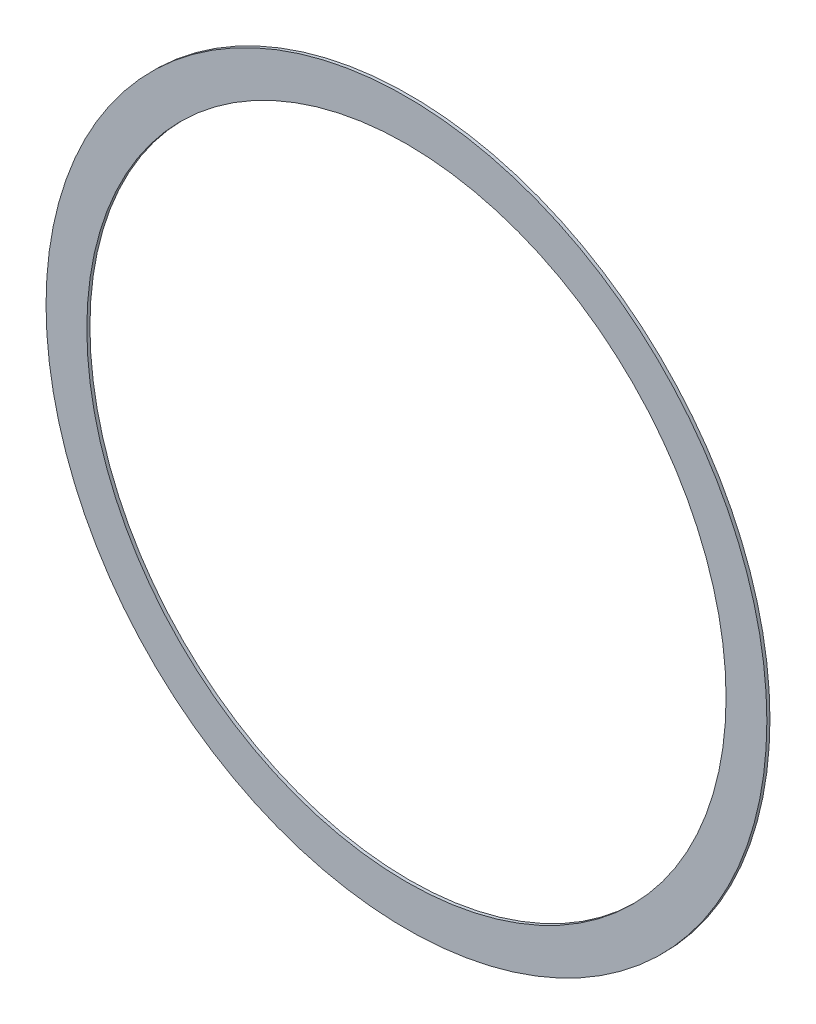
ISO-10303-21;
HEADER;
FILE_DESCRIPTION(('STEP AP214'),'2;1');
FILE_NAME('part.step','',(''),(''),'','','');
FILE_SCHEMA(('AUTOMOTIVE_DESIGN { 1 0 10303 214 1 1 1 1 }'));
ENDSEC;
DATA;
#1=APPLICATION_CONTEXT('core data for automotive mechanical design processes');
#2=APPLICATION_PROTOCOL_DEFINITION('international standard','automotive_design',2000,#1);
#3=PRODUCT_CONTEXT('',#1,'mechanical');
#4=PRODUCT('Part','Part','',(#3));
#5=PRODUCT_RELATED_PRODUCT_CATEGORY('part','',(#4));
#6=PRODUCT_DEFINITION_FORMATION('','',#4);
#7=PRODUCT_DEFINITION_CONTEXT('part definition',#1,'design');
#8=PRODUCT_DEFINITION('design','',#6,#7);
#9=PRODUCT_DEFINITION_SHAPE('','',#8);
#10=(LENGTH_UNIT() NAMED_UNIT(*) SI_UNIT(.MILLI.,.METRE.));
#11=(NAMED_UNIT(*) PLANE_ANGLE_UNIT() SI_UNIT($,.RADIAN.));
#12=(NAMED_UNIT(*) SI_UNIT($,.STERADIAN.) SOLID_ANGLE_UNIT());
#13=UNCERTAINTY_MEASURE_WITH_UNIT(LENGTH_MEASURE(1.E-05),#10,'distance_accuracy_value','');
#14=(GEOMETRIC_REPRESENTATION_CONTEXT(3) GLOBAL_UNCERTAINTY_ASSIGNED_CONTEXT((#13)) GLOBAL_UNIT_ASSIGNED_CONTEXT((#10,
#11,#12)) REPRESENTATION_CONTEXT('',''));
#15=CARTESIAN_POINT('',(0.,0.,0.));
#16=DIRECTION('',(0.,0.,1.));
#17=DIRECTION('',(1.,0.,0.));
#18=AXIS2_PLACEMENT_3D('',#15,#16,#17);
#19=CARTESIAN_POINT('',(0.,0.,3.));
#20=DIRECTION('',(0.,0.,1.));
#21=DIRECTION('',(1.,0.,0.));
#22=AXIS2_PLACEMENT_3D('',#19,#20,#21);
#23=PLANE('',#22);
#24=CARTESIAN_POINT('',(0.,0.,3.));
#25=DIRECTION('',(0.,0.,1.));
#26=DIRECTION('',(1.,0.,0.));
#27=AXIS2_PLACEMENT_3D('',#24,#25,#26);
#28=CIRCLE('',#27,349.);
#29=CARTESIAN_POINT('',(349.,0.,3.));
#30=VERTEX_POINT('',#29);
#31=EDGE_CURVE('E10',#30,#30,#28,.T.);
#32=ORIENTED_EDGE('',*,*,#31,.T.);
#33=EDGE_LOOP('',(#32));
#34=FACE_BOUND('',#33,.T.);
#35=CARTESIAN_POINT('',(0.,0.,3.));
#36=DIRECTION('',(0.,0.,1.));
#37=DIRECTION('',(1.,0.,0.));
#38=AXIS2_PLACEMENT_3D('',#35,#36,#37);
#39=CIRCLE('',#38,309.5);
#40=CARTESIAN_POINT('',(309.5,0.,3.));
#41=VERTEX_POINT('',#40);
#42=EDGE_CURVE('E40',#41,#41,#39,.T.);
#43=ORIENTED_EDGE('',*,*,#42,.F.);
#44=EDGE_LOOP('',(#43));
#45=FACE_BOUND('',#44,.T.);
#46=ADVANCED_FACE('F29',(#34,#45),#23,.T.);
#47=CARTESIAN_POINT('',(0.,0.,0.));
#48=DIRECTION('',(0.,0.,1.));
#49=DIRECTION('',(1.,0.,0.));
#50=AXIS2_PLACEMENT_3D('',#47,#48,#49);
#51=PLANE('',#50);
#52=CARTESIAN_POINT('',(0.,0.,0.));
#53=DIRECTION('',(0.,0.,1.));
#54=DIRECTION('',(1.,0.,0.));
#55=AXIS2_PLACEMENT_3D('',#52,#53,#54);
#56=CIRCLE('',#55,349.);
#57=CARTESIAN_POINT('',(349.,0.,0.));
#58=VERTEX_POINT('',#57);
#59=EDGE_CURVE('E33',#58,#58,#56,.T.);
#60=ORIENTED_EDGE('',*,*,#59,.F.);
#61=EDGE_LOOP('',(#60));
#62=FACE_BOUND('',#61,.T.);
#63=CARTESIAN_POINT('',(0.,0.,0.));
#64=DIRECTION('',(0.,0.,1.));
#65=DIRECTION('',(1.,0.,0.));
#66=AXIS2_PLACEMENT_3D('',#63,#64,#65);
#67=CIRCLE('',#66,309.5);
#68=CARTESIAN_POINT('',(309.5,0.,0.));
#69=VERTEX_POINT('',#68);
#70=EDGE_CURVE('E42',#69,#69,#67,.T.);
#71=ORIENTED_EDGE('',*,*,#70,.T.);
#72=EDGE_LOOP('',(#71));
#73=FACE_BOUND('',#72,.T.);
#74=ADVANCED_FACE('F52',(#62,#73),#51,.F.);
#75=CARTESIAN_POINT('',(0.,0.,3.));
#76=DIRECTION('',(0.,0.,-1.));
#77=DIRECTION('',(-1.,0.,0.));
#78=AXIS2_PLACEMENT_3D('',#75,#76,#77);
#79=CYLINDRICAL_SURFACE('',#78,349.);
#80=ORIENTED_EDGE('',*,*,#31,.F.);
#81=EDGE_LOOP('',(#80));
#82=FACE_BOUND('',#81,.T.);
#83=ORIENTED_EDGE('',*,*,#59,.T.);
#84=EDGE_LOOP('',(#83));
#85=FACE_BOUND('',#84,.T.);
#86=ADVANCED_FACE('F31',(#82,#85),#79,.T.);
#87=CARTESIAN_POINT('',(0.,0.,3.));
#88=DIRECTION('',(0.,0.,-1.));
#89=DIRECTION('',(-1.,0.,0.));
#90=AXIS2_PLACEMENT_3D('',#87,#88,#89);
#91=CYLINDRICAL_SURFACE('',#90,309.5);
#92=ORIENTED_EDGE('',*,*,#42,.T.);
#93=EDGE_LOOP('',(#92));
#94=FACE_BOUND('',#93,.T.);
#95=ORIENTED_EDGE('',*,*,#70,.F.);
#96=EDGE_LOOP('',(#95));
#97=FACE_BOUND('',#96,.T.);
#98=ADVANCED_FACE('F48',(#94,#97),#91,.F.);
#99=CLOSED_SHELL('',(#46,#74,#86,#98));
#100=MANIFOLD_SOLID_BREP('B2',#99);
#101=ADVANCED_BREP_SHAPE_REPRESENTATION('',(#18,#100),#14);
#102=SHAPE_DEFINITION_REPRESENTATION(#9,#101);
ENDSEC;
END-ISO-10303-21;
